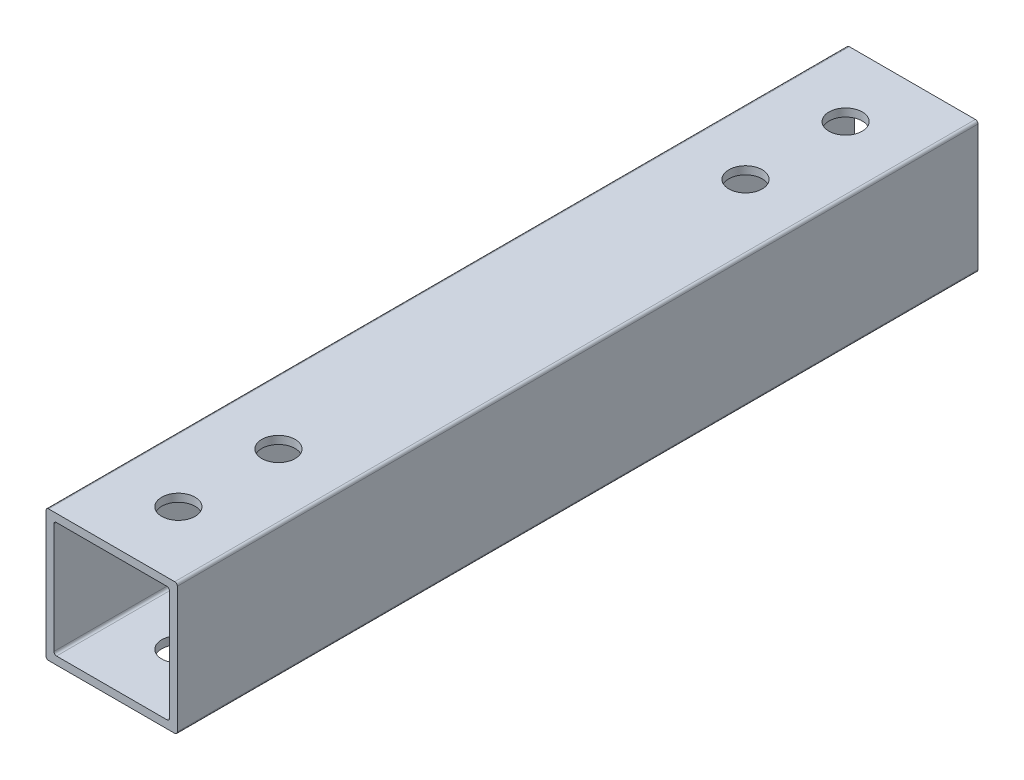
ISO-10303-21;
HEADER;
FILE_DESCRIPTION(('STEP AP214'),'2;1');
FILE_NAME('part.step','',(''),(''),'','','');
FILE_SCHEMA(('AUTOMOTIVE_DESIGN { 1 0 10303 214 1 1 1 1 }'));
ENDSEC;
DATA;
#1=APPLICATION_CONTEXT('core data for automotive mechanical design processes');
#2=APPLICATION_PROTOCOL_DEFINITION('international standard','automotive_design',2000,#1);
#3=PRODUCT_CONTEXT('',#1,'mechanical');
#4=PRODUCT('Part','Part','',(#3));
#5=PRODUCT_RELATED_PRODUCT_CATEGORY('part','',(#4));
#6=PRODUCT_DEFINITION_FORMATION('','',#4);
#7=PRODUCT_DEFINITION_CONTEXT('part definition',#1,'design');
#8=PRODUCT_DEFINITION('design','',#6,#7);
#9=PRODUCT_DEFINITION_SHAPE('','',#8);
#10=(LENGTH_UNIT() NAMED_UNIT(*) SI_UNIT(.MILLI.,.METRE.));
#11=(NAMED_UNIT(*) PLANE_ANGLE_UNIT() SI_UNIT($,.RADIAN.));
#12=(NAMED_UNIT(*) SI_UNIT($,.STERADIAN.) SOLID_ANGLE_UNIT());
#13=UNCERTAINTY_MEASURE_WITH_UNIT(LENGTH_MEASURE(1.E-05),#10,'distance_accuracy_value','');
#14=(GEOMETRIC_REPRESENTATION_CONTEXT(3) GLOBAL_UNCERTAINTY_ASSIGNED_CONTEXT((#13)) GLOBAL_UNIT_ASSIGNED_CONTEXT((#10,
#11,#12)) REPRESENTATION_CONTEXT('',''));
#15=CARTESIAN_POINT('',(0.,0.,0.));
#16=DIRECTION('',(0.,0.,1.));
#17=DIRECTION('',(1.,0.,0.));
#18=AXIS2_PLACEMENT_3D('',#15,#16,#17);
#19=CARTESIAN_POINT('',(-11.9999999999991,-11.9999999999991,-1847.6));
#20=DIRECTION('',(0.,0.,-1.));
#21=DIRECTION('',(-1.,0.,0.));
#22=AXIS2_PLACEMENT_3D('',#19,#20,#21);
#23=CYLINDRICAL_SURFACE('',#22,0.500000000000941);
#24=CARTESIAN_POINT('',(-11.9999999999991,-11.9999999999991,-2000.));
#25=DIRECTION('',(0.,0.,-1.));
#26=DIRECTION('',(-1.,0.,0.));
#27=AXIS2_PLACEMENT_3D('',#24,#25,#26);
#28=CIRCLE('',#27,0.500000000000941);
#29=CARTESIAN_POINT('',(-11.9999999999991,-12.5,-2000.));
#30=VERTEX_POINT('',#29);
#31=CARTESIAN_POINT('',(-12.5,-11.9999999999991,-2000.));
#32=VERTEX_POINT('',#31);
#33=EDGE_CURVE('E210',#30,#32,#28,.T.);
#34=ORIENTED_EDGE('',*,*,#33,.F.);
#35=DIRECTION('',(0.,0.,-1.));
#36=VECTOR('',#35,1.);
#37=CARTESIAN_POINT('',(-11.9999999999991,-12.5,-1847.6));
#38=LINE('',#37,#36);
#39=CARTESIAN_POINT('',(-11.9999999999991,-12.5,-1847.6));
#40=VERTEX_POINT('',#39);
#41=EDGE_CURVE('E11',#40,#30,#38,.T.);
#42=ORIENTED_EDGE('',*,*,#41,.F.);
#43=CARTESIAN_POINT('',(-11.9999999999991,-11.9999999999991,-1847.6));
#44=DIRECTION('',(0.,0.,-1.));
#45=DIRECTION('',(-1.,0.,0.));
#46=AXIS2_PLACEMENT_3D('',#43,#44,#45);
#47=CIRCLE('',#46,0.500000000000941);
#48=CARTESIAN_POINT('',(-12.5,-11.9999999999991,-1847.6));
#49=VERTEX_POINT('',#48);
#50=EDGE_CURVE('E222',#40,#49,#47,.T.);
#51=ORIENTED_EDGE('',*,*,#50,.T.);
#52=DIRECTION('',(0.,0.,-1.));
#53=VECTOR('',#52,1.);
#54=CARTESIAN_POINT('',(-12.5,-11.9999999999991,-1847.6));
#55=LINE('',#54,#53);
#56=EDGE_CURVE('E247',#49,#32,#55,.T.);
#57=ORIENTED_EDGE('',*,*,#56,.T.);
#58=EDGE_LOOP('',(#34,#42,#51,#57));
#59=FACE_BOUND('',#58,.T.);
#60=ADVANCED_FACE('F37',(#59),#23,.T.);
#61=CARTESIAN_POINT('',(11.9999999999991,-12.5,-1847.6));
#62=DIRECTION('',(0.,-1.,0.));
#63=DIRECTION('',(1.,0.,0.));
#64=AXIS2_PLACEMENT_3D('',#61,#62,#63);
#65=PLANE('',#64);
#66=CARTESIAN_POINT('',(0.,-12.5,-1860.3));
#67=DIRECTION('',(0.,-1.,0.));
#68=DIRECTION('',(1.,0.,0.));
#69=AXIS2_PLACEMENT_3D('',#66,#67,#68);
#70=CIRCLE('',#69,3.17500000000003);
#71=CARTESIAN_POINT('',(3.17500000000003,-12.5,-1860.3));
#72=VERTEX_POINT('',#71);
#73=EDGE_CURVE('E286',#72,#72,#70,.F.);
#74=ORIENTED_EDGE('',*,*,#73,.T.);
#75=EDGE_LOOP('',(#74));
#76=FACE_BOUND('',#75,.T.);
#77=CARTESIAN_POINT('',(0.,-12.5,-1968.25));
#78=DIRECTION('',(0.,-1.,0.));
#79=DIRECTION('',(1.,0.,0.));
#80=AXIS2_PLACEMENT_3D('',#77,#78,#79);
#81=CIRCLE('',#80,3.17500000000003);
#82=CARTESIAN_POINT('',(3.17500000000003,-12.5,-1968.25));
#83=VERTEX_POINT('',#82);
#84=EDGE_CURVE('E319',#83,#83,#81,.F.);
#85=ORIENTED_EDGE('',*,*,#84,.T.);
#86=EDGE_LOOP('',(#85));
#87=FACE_BOUND('',#86,.T.);
#88=CARTESIAN_POINT('',(0.,-12.5,-1987.3));
#89=DIRECTION('',(0.,-1.,0.));
#90=DIRECTION('',(1.,0.,0.));
#91=AXIS2_PLACEMENT_3D('',#88,#89,#90);
#92=CIRCLE('',#91,3.17500000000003);
#93=CARTESIAN_POINT('',(3.17500000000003,-12.5,-1987.3));
#94=VERTEX_POINT('',#93);
#95=EDGE_CURVE('E307',#94,#94,#92,.F.);
#96=ORIENTED_EDGE('',*,*,#95,.T.);
#97=EDGE_LOOP('',(#96));
#98=FACE_BOUND('',#97,.T.);
#99=CARTESIAN_POINT('',(0.,-12.5,-1879.35));
#100=DIRECTION('',(0.,-1.,0.));
#101=DIRECTION('',(1.,0.,0.));
#102=AXIS2_PLACEMENT_3D('',#99,#100,#101);
#103=CIRCLE('',#102,3.17500000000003);
#104=CARTESIAN_POINT('',(3.17500000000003,-12.5,-1879.35));
#105=VERTEX_POINT('',#104);
#106=EDGE_CURVE('E306',#105,#105,#103,.F.);
#107=ORIENTED_EDGE('',*,*,#106,.T.);
#108=EDGE_LOOP('',(#107));
#109=FACE_BOUND('',#108,.T.);
#110=DIRECTION('',(-1.,0.,0.));
#111=VECTOR('',#110,1.);
#112=CARTESIAN_POINT('',(11.9999999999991,-12.5,-2000.));
#113=LINE('',#112,#111);
#114=CARTESIAN_POINT('',(11.9999999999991,-12.5,-2000.));
#115=VERTEX_POINT('',#114);
#116=EDGE_CURVE('E226',#115,#30,#113,.T.);
#117=ORIENTED_EDGE('',*,*,#116,.F.);
#118=DIRECTION('',(0.,0.,-1.));
#119=VECTOR('',#118,1.);
#120=CARTESIAN_POINT('',(11.9999999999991,-12.5,-1847.6));
#121=LINE('',#120,#119);
#122=CARTESIAN_POINT('',(11.9999999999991,-12.5,-1847.6));
#123=VERTEX_POINT('',#122);
#124=EDGE_CURVE('E45',#123,#115,#121,.T.);
#125=ORIENTED_EDGE('',*,*,#124,.F.);
#126=DIRECTION('',(-1.,0.,0.));
#127=VECTOR('',#126,1.);
#128=CARTESIAN_POINT('',(11.9999999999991,-12.5,-1847.6));
#129=LINE('',#128,#127);
#130=EDGE_CURVE('E244',#123,#40,#129,.T.);
#131=ORIENTED_EDGE('',*,*,#130,.T.);
#132=ORIENTED_EDGE('',*,*,#41,.T.);
#133=EDGE_LOOP('',(#117,#125,#131,#132));
#134=FACE_BOUND('',#133,.T.);
#135=ADVANCED_FACE('F362',(#76,#87,#98,#109,#134),#65,.T.);
#136=CARTESIAN_POINT('',(11.9999999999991,-11.9999999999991,-1847.6));
#137=DIRECTION('',(0.,0.,-1.));
#138=DIRECTION('',(-1.,0.,0.));
#139=AXIS2_PLACEMENT_3D('',#136,#137,#138);
#140=CYLINDRICAL_SURFACE('',#139,0.500000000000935);
#141=CARTESIAN_POINT('',(11.9999999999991,-11.9999999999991,-2000.));
#142=DIRECTION('',(0.,0.,-1.));
#143=DIRECTION('',(-1.,0.,0.));
#144=AXIS2_PLACEMENT_3D('',#141,#142,#143);
#145=CIRCLE('',#144,0.500000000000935);
#146=CARTESIAN_POINT('',(12.5,-11.9999999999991,-2000.));
#147=VERTEX_POINT('',#146);
#148=EDGE_CURVE('E265',#147,#115,#145,.T.);
#149=ORIENTED_EDGE('',*,*,#148,.F.);
#150=DIRECTION('',(0.,0.,-1.));
#151=VECTOR('',#150,1.);
#152=CARTESIAN_POINT('',(12.5,-11.9999999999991,-1847.6));
#153=LINE('',#152,#151);
#154=CARTESIAN_POINT('',(12.5,-11.9999999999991,-1847.6));
#155=VERTEX_POINT('',#154);
#156=EDGE_CURVE('E271',#155,#147,#153,.T.);
#157=ORIENTED_EDGE('',*,*,#156,.F.);
#158=CARTESIAN_POINT('',(11.9999999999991,-11.9999999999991,-1847.6));
#159=DIRECTION('',(0.,0.,-1.));
#160=DIRECTION('',(-1.,0.,0.));
#161=AXIS2_PLACEMENT_3D('',#158,#159,#160);
#162=CIRCLE('',#161,0.500000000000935);
#163=EDGE_CURVE('E241',#155,#123,#162,.T.);
#164=ORIENTED_EDGE('',*,*,#163,.T.);
#165=ORIENTED_EDGE('',*,*,#124,.T.);
#166=EDGE_LOOP('',(#149,#157,#164,#165));
#167=FACE_BOUND('',#166,.T.);
#168=ADVANCED_FACE('F365',(#167),#140,.T.);
#169=CARTESIAN_POINT('',(12.5,11.9999999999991,-1847.6));
#170=DIRECTION('',(1.,0.,0.));
#171=DIRECTION('',(0.,1.,0.));
#172=AXIS2_PLACEMENT_3D('',#169,#170,#171);
#173=PLANE('',#172);
#174=DIRECTION('',(0.,-1.,0.));
#175=VECTOR('',#174,1.);
#176=CARTESIAN_POINT('',(12.5,11.9999999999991,-2000.));
#177=LINE('',#176,#175);
#178=CARTESIAN_POINT('',(12.5,11.9999999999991,-2000.));
#179=VERTEX_POINT('',#178);
#180=EDGE_CURVE('E262',#179,#147,#177,.T.);
#181=ORIENTED_EDGE('',*,*,#180,.F.);
#182=DIRECTION('',(0.,0.,-1.));
#183=VECTOR('',#182,1.);
#184=CARTESIAN_POINT('',(12.5,11.9999999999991,-1847.6));
#185=LINE('',#184,#183);
#186=CARTESIAN_POINT('',(12.5,11.9999999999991,-1847.6));
#187=VERTEX_POINT('',#186);
#188=EDGE_CURVE('E273',#187,#179,#185,.T.);
#189=ORIENTED_EDGE('',*,*,#188,.F.);
#190=DIRECTION('',(0.,-1.,0.));
#191=VECTOR('',#190,1.);
#192=CARTESIAN_POINT('',(12.5,11.9999999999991,-1847.6));
#193=LINE('',#192,#191);
#194=EDGE_CURVE('E238',#187,#155,#193,.T.);
#195=ORIENTED_EDGE('',*,*,#194,.T.);
#196=ORIENTED_EDGE('',*,*,#156,.T.);
#197=EDGE_LOOP('',(#181,#189,#195,#196));
#198=FACE_BOUND('',#197,.T.);
#199=ADVANCED_FACE('F369',(#198),#173,.T.);
#200=CARTESIAN_POINT('',(11.9999999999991,11.9999999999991,-1847.6));
#201=DIRECTION('',(0.,0.,-1.));
#202=DIRECTION('',(-1.,0.,0.));
#203=AXIS2_PLACEMENT_3D('',#200,#201,#202);
#204=CYLINDRICAL_SURFACE('',#203,0.500000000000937);
#205=CARTESIAN_POINT('',(11.9999999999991,11.9999999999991,-2000.));
#206=DIRECTION('',(0.,0.,-1.));
#207=DIRECTION('',(-1.,0.,0.));
#208=AXIS2_PLACEMENT_3D('',#205,#206,#207);
#209=CIRCLE('',#208,0.500000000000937);
#210=CARTESIAN_POINT('',(11.9999999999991,12.5,-2000.));
#211=VERTEX_POINT('',#210);
#212=EDGE_CURVE('E259',#211,#179,#209,.T.);
#213=ORIENTED_EDGE('',*,*,#212,.F.);
#214=DIRECTION('',(0.,0.,-1.));
#215=VECTOR('',#214,1.);
#216=CARTESIAN_POINT('',(11.9999999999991,12.5,-1847.6));
#217=LINE('',#216,#215);
#218=CARTESIAN_POINT('',(11.9999999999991,12.5,-1847.6));
#219=VERTEX_POINT('',#218);
#220=EDGE_CURVE('E275',#219,#211,#217,.T.);
#221=ORIENTED_EDGE('',*,*,#220,.F.);
#222=CARTESIAN_POINT('',(11.9999999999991,11.9999999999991,-1847.6));
#223=DIRECTION('',(0.,0.,-1.));
#224=DIRECTION('',(-1.,0.,0.));
#225=AXIS2_PLACEMENT_3D('',#222,#223,#224);
#226=CIRCLE('',#225,0.500000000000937);
#227=EDGE_CURVE('E235',#219,#187,#226,.T.);
#228=ORIENTED_EDGE('',*,*,#227,.T.);
#229=ORIENTED_EDGE('',*,*,#188,.T.);
#230=EDGE_LOOP('',(#213,#221,#228,#229));
#231=FACE_BOUND('',#230,.T.);
#232=ADVANCED_FACE('F334',(#231),#204,.T.);
#233=CARTESIAN_POINT('',(-11.9999999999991,12.5,-1847.6));
#234=DIRECTION('',(0.,1.,0.));
#235=DIRECTION('',(-1.,0.,0.));
#236=AXIS2_PLACEMENT_3D('',#233,#234,#235);
#237=PLANE('',#236);
#238=CARTESIAN_POINT('',(0.,12.5,-1860.3));
#239=DIRECTION('',(0.,1.,0.));
#240=DIRECTION('',(-1.,0.,0.));
#241=AXIS2_PLACEMENT_3D('',#238,#239,#240);
#242=CIRCLE('',#241,3.17500000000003);
#243=CARTESIAN_POINT('',(-3.17500000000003,12.5,-1860.3));
#244=VERTEX_POINT('',#243);
#245=EDGE_CURVE('E314',#244,#244,#242,.T.);
#246=ORIENTED_EDGE('',*,*,#245,.F.);
#247=EDGE_LOOP('',(#246));
#248=FACE_BOUND('',#247,.T.);
#249=CARTESIAN_POINT('',(0.,12.5,-1968.25));
#250=DIRECTION('',(0.,1.,0.));
#251=DIRECTION('',(1.,0.,0.));
#252=AXIS2_PLACEMENT_3D('',#249,#250,#251);
#253=CIRCLE('',#252,3.17500000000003);
#254=CARTESIAN_POINT('',(3.17500000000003,12.5,-1968.25));
#255=VERTEX_POINT('',#254);
#256=EDGE_CURVE('E310',#255,#255,#253,.T.);
#257=ORIENTED_EDGE('',*,*,#256,.F.);
#258=EDGE_LOOP('',(#257));
#259=FACE_BOUND('',#258,.T.);
#260=CARTESIAN_POINT('',(0.,12.5,-1987.3));
#261=DIRECTION('',(0.,1.,0.));
#262=DIRECTION('',(1.,0.,0.));
#263=AXIS2_PLACEMENT_3D('',#260,#261,#262);
#264=CIRCLE('',#263,3.17500000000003);
#265=CARTESIAN_POINT('',(3.17500000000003,12.5,-1987.3));
#266=VERTEX_POINT('',#265);
#267=EDGE_CURVE('E303',#266,#266,#264,.T.);
#268=ORIENTED_EDGE('',*,*,#267,.F.);
#269=EDGE_LOOP('',(#268));
#270=FACE_BOUND('',#269,.T.);
#271=CARTESIAN_POINT('',(0.,12.5,-1879.35));
#272=DIRECTION('',(0.,1.,0.));
#273=DIRECTION('',(-1.,0.,0.));
#274=AXIS2_PLACEMENT_3D('',#271,#272,#273);
#275=CIRCLE('',#274,3.17500000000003);
#276=CARTESIAN_POINT('',(-3.17500000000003,12.5,-1879.35));
#277=VERTEX_POINT('',#276);
#278=EDGE_CURVE('E311',#277,#277,#275,.T.);
#279=ORIENTED_EDGE('',*,*,#278,.F.);
#280=EDGE_LOOP('',(#279));
#281=FACE_BOUND('',#280,.T.);
#282=DIRECTION('',(1.,0.,0.));
#283=VECTOR('',#282,1.);
#284=CARTESIAN_POINT('',(-11.9999999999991,12.5,-2000.));
#285=LINE('',#284,#283);
#286=CARTESIAN_POINT('',(-11.9999999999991,12.5,-2000.));
#287=VERTEX_POINT('',#286);
#288=EDGE_CURVE('E256',#287,#211,#285,.T.);
#289=ORIENTED_EDGE('',*,*,#288,.F.);
#290=DIRECTION('',(0.,0.,-1.));
#291=VECTOR('',#290,1.);
#292=CARTESIAN_POINT('',(-11.9999999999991,12.5,-1847.6));
#293=LINE('',#292,#291);
#294=CARTESIAN_POINT('',(-11.9999999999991,12.5,-1847.6));
#295=VERTEX_POINT('',#294);
#296=EDGE_CURVE('E277',#295,#287,#293,.T.);
#297=ORIENTED_EDGE('',*,*,#296,.F.);
#298=DIRECTION('',(1.,0.,0.));
#299=VECTOR('',#298,1.);
#300=CARTESIAN_POINT('',(-11.9999999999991,12.5,-1847.6));
#301=LINE('',#300,#299);
#302=EDGE_CURVE('E232',#295,#219,#301,.T.);
#303=ORIENTED_EDGE('',*,*,#302,.T.);
#304=ORIENTED_EDGE('',*,*,#220,.T.);
#305=EDGE_LOOP('',(#289,#297,#303,#304));
#306=FACE_BOUND('',#305,.T.);
#307=ADVANCED_FACE('F330',(#248,#259,#270,#281,#306),#237,.T.);
#308=CARTESIAN_POINT('',(-11.9999999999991,11.9999999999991,-1847.6));
#309=DIRECTION('',(0.,0.,-1.));
#310=DIRECTION('',(-1.,0.,0.));
#311=AXIS2_PLACEMENT_3D('',#308,#309,#310);
#312=CYLINDRICAL_SURFACE('',#311,0.500000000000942);
#313=CARTESIAN_POINT('',(-11.9999999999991,11.9999999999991,-2000.));
#314=DIRECTION('',(0.,0.,-1.));
#315=DIRECTION('',(-1.,0.,0.));
#316=AXIS2_PLACEMENT_3D('',#313,#314,#315);
#317=CIRCLE('',#316,0.500000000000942);
#318=CARTESIAN_POINT('',(-12.5,11.9999999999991,-2000.));
#319=VERTEX_POINT('',#318);
#320=EDGE_CURVE('E253',#319,#287,#317,.T.);
#321=ORIENTED_EDGE('',*,*,#320,.F.);
#322=DIRECTION('',(0.,0.,-1.));
#323=VECTOR('',#322,1.);
#324=CARTESIAN_POINT('',(-12.5,11.9999999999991,-1847.6));
#325=LINE('',#324,#323);
#326=CARTESIAN_POINT('',(-12.5,11.9999999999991,-1847.6));
#327=VERTEX_POINT('',#326);
#328=EDGE_CURVE('E279',#327,#319,#325,.T.);
#329=ORIENTED_EDGE('',*,*,#328,.F.);
#330=CARTESIAN_POINT('',(-11.9999999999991,11.9999999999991,-1847.6));
#331=DIRECTION('',(0.,0.,-1.));
#332=DIRECTION('',(-1.,0.,0.));
#333=AXIS2_PLACEMENT_3D('',#330,#331,#332);
#334=CIRCLE('',#333,0.500000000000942);
#335=EDGE_CURVE('E229',#327,#295,#334,.T.);
#336=ORIENTED_EDGE('',*,*,#335,.T.);
#337=ORIENTED_EDGE('',*,*,#296,.T.);
#338=EDGE_LOOP('',(#321,#329,#336,#337));
#339=FACE_BOUND('',#338,.T.);
#340=ADVANCED_FACE('F333',(#339),#312,.T.);
#341=CARTESIAN_POINT('',(-12.5,-11.9999999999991,-1847.6));
#342=DIRECTION('',(-1.,0.,0.));
#343=DIRECTION('',(0.,0.,1.));
#344=AXIS2_PLACEMENT_3D('',#341,#342,#343);
#345=PLANE('',#344);
#346=DIRECTION('',(0.,1.,0.));
#347=VECTOR('',#346,1.);
#348=CARTESIAN_POINT('',(-12.5,-11.9999999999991,-2000.));
#349=LINE('',#348,#347);
#350=EDGE_CURVE('E250',#32,#319,#349,.T.);
#351=ORIENTED_EDGE('',*,*,#350,.F.);
#352=ORIENTED_EDGE('',*,*,#56,.F.);
#353=DIRECTION('',(0.,1.,0.));
#354=VECTOR('',#353,1.);
#355=CARTESIAN_POINT('',(-12.5,-11.9999999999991,-1847.6));
#356=LINE('',#355,#354);
#357=EDGE_CURVE('E225',#49,#327,#356,.T.);
#358=ORIENTED_EDGE('',*,*,#357,.T.);
#359=ORIENTED_EDGE('',*,*,#328,.T.);
#360=EDGE_LOOP('',(#351,#352,#358,#359));
#361=FACE_BOUND('',#360,.T.);
#362=ADVANCED_FACE('F355',(#361),#345,.T.);
#363=CARTESIAN_POINT('',(-11.9999999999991,-11.9999999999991,-1847.6));
#364=DIRECTION('',(0.,0.,-1.));
#365=DIRECTION('',(-1.,0.,0.));
#366=AXIS2_PLACEMENT_3D('',#363,#364,#365);
#367=PLANE('',#366);
#368=DIRECTION('',(0.,1.,0.));
#369=VECTOR('',#368,1.);
#370=CARTESIAN_POINT('',(-11.,10.4999999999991,-1847.6));
#371=LINE('',#370,#369);
#372=CARTESIAN_POINT('',(-11.,-10.4999999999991,-1847.6));
#373=VERTEX_POINT('',#372);
#374=CARTESIAN_POINT('',(-11.,10.4999999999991,-1847.6));
#375=VERTEX_POINT('',#374);
#376=EDGE_CURVE('E158',#373,#375,#371,.T.);
#377=ORIENTED_EDGE('',*,*,#376,.T.);
#378=CARTESIAN_POINT('',(-10.4999999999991,10.4999999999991,-1847.6));
#379=DIRECTION('',(0.,0.,-1.));
#380=DIRECTION('',(1.,0.,0.));
#381=AXIS2_PLACEMENT_3D('',#378,#379,#380);
#382=CIRCLE('',#381,0.500000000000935);
#383=CARTESIAN_POINT('',(-10.4999999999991,11.,-1847.6));
#384=VERTEX_POINT('',#383);
#385=EDGE_CURVE('E152',#375,#384,#382,.T.);
#386=ORIENTED_EDGE('',*,*,#385,.T.);
#387=DIRECTION('',(1.,0.,0.));
#388=VECTOR('',#387,1.);
#389=CARTESIAN_POINT('',(10.4999999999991,11.,-1847.6));
#390=LINE('',#389,#388);
#391=CARTESIAN_POINT('',(10.4999999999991,11.,-1847.6));
#392=VERTEX_POINT('',#391);
#393=EDGE_CURVE('E161',#384,#392,#390,.T.);
#394=ORIENTED_EDGE('',*,*,#393,.T.);
#395=CARTESIAN_POINT('',(10.4999999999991,10.4999999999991,-1847.6));
#396=DIRECTION('',(0.,0.,-1.));
#397=DIRECTION('',(1.,0.,0.));
#398=AXIS2_PLACEMENT_3D('',#395,#396,#397);
#399=CIRCLE('',#398,0.500000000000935);
#400=CARTESIAN_POINT('',(11.,10.4999999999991,-1847.6));
#401=VERTEX_POINT('',#400);
#402=EDGE_CURVE('E53',#392,#401,#399,.T.);
#403=ORIENTED_EDGE('',*,*,#402,.T.);
#404=DIRECTION('',(0.,-1.,0.));
#405=VECTOR('',#404,1.);
#406=CARTESIAN_POINT('',(11.,-10.4999999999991,-1847.6));
#407=LINE('',#406,#405);
#408=CARTESIAN_POINT('',(11.,-10.4999999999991,-1847.6));
#409=VERTEX_POINT('',#408);
#410=EDGE_CURVE('E179',#401,#409,#407,.T.);
#411=ORIENTED_EDGE('',*,*,#410,.T.);
#412=CARTESIAN_POINT('',(10.4999999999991,-10.4999999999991,-1847.6));
#413=DIRECTION('',(0.,0.,-1.));
#414=DIRECTION('',(1.,0.,0.));
#415=AXIS2_PLACEMENT_3D('',#412,#413,#414);
#416=CIRCLE('',#415,0.500000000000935);
#417=CARTESIAN_POINT('',(10.4999999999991,-11.,-1847.6));
#418=VERTEX_POINT('',#417);
#419=EDGE_CURVE('E182',#409,#418,#416,.T.);
#420=ORIENTED_EDGE('',*,*,#419,.T.);
#421=DIRECTION('',(-1.,0.,0.));
#422=VECTOR('',#421,1.);
#423=CARTESIAN_POINT('',(-10.4999999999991,-11.,-1847.6));
#424=LINE('',#423,#422);
#425=CARTESIAN_POINT('',(-10.4999999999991,-11.,-1847.6));
#426=VERTEX_POINT('',#425);
#427=EDGE_CURVE('E185',#418,#426,#424,.T.);
#428=ORIENTED_EDGE('',*,*,#427,.T.);
#429=CARTESIAN_POINT('',(-10.4999999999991,-10.4999999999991,-1847.6));
#430=DIRECTION('',(0.,0.,-1.));
#431=DIRECTION('',(1.,0.,0.));
#432=AXIS2_PLACEMENT_3D('',#429,#430,#431);
#433=CIRCLE('',#432,0.500000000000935);
#434=EDGE_CURVE('E188',#426,#373,#433,.T.);
#435=ORIENTED_EDGE('',*,*,#434,.T.);
#436=EDGE_LOOP('',(#377,#386,#394,#403,#411,#420,#428,#435));
#437=FACE_BOUND('',#436,.T.);
#438=ORIENTED_EDGE('',*,*,#50,.F.);
#439=ORIENTED_EDGE('',*,*,#130,.F.);
#440=ORIENTED_EDGE('',*,*,#163,.F.);
#441=ORIENTED_EDGE('',*,*,#194,.F.);
#442=ORIENTED_EDGE('',*,*,#227,.F.);
#443=ORIENTED_EDGE('',*,*,#302,.F.);
#444=ORIENTED_EDGE('',*,*,#335,.F.);
#445=ORIENTED_EDGE('',*,*,#357,.F.);
#446=EDGE_LOOP('',(#438,#439,#440,#441,#442,#443,#444,#445));
#447=FACE_BOUND('',#446,.T.);
#448=ADVANCED_FACE('F165',(#437,#447),#367,.F.);
#449=CARTESIAN_POINT('',(-11.9999999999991,-11.9999999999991,-2000.));
#450=DIRECTION('',(0.,0.,-1.));
#451=DIRECTION('',(-1.,0.,0.));
#452=AXIS2_PLACEMENT_3D('',#449,#450,#451);
#453=PLANE('',#452);
#454=CARTESIAN_POINT('',(-10.4999999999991,10.4999999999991,-2000.));
#455=DIRECTION('',(0.,0.,-1.));
#456=DIRECTION('',(1.,0.,0.));
#457=AXIS2_PLACEMENT_3D('',#454,#455,#456);
#458=CIRCLE('',#457,0.500000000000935);
#459=CARTESIAN_POINT('',(-11.,10.4999999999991,-2000.));
#460=VERTEX_POINT('',#459);
#461=CARTESIAN_POINT('',(-10.4999999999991,11.,-2000.));
#462=VERTEX_POINT('',#461);
#463=EDGE_CURVE('E61',#460,#462,#458,.T.);
#464=ORIENTED_EDGE('',*,*,#463,.F.);
#465=DIRECTION('',(0.,1.,0.));
#466=VECTOR('',#465,1.);
#467=CARTESIAN_POINT('',(-11.,10.4999999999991,-2000.));
#468=LINE('',#467,#466);
#469=CARTESIAN_POINT('',(-11.,-10.4999999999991,-2000.));
#470=VERTEX_POINT('',#469);
#471=EDGE_CURVE('E169',#470,#460,#468,.T.);
#472=ORIENTED_EDGE('',*,*,#471,.F.);
#473=CARTESIAN_POINT('',(-10.4999999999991,-10.4999999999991,-2000.));
#474=DIRECTION('',(0.,0.,-1.));
#475=DIRECTION('',(1.,0.,0.));
#476=AXIS2_PLACEMENT_3D('',#473,#474,#475);
#477=CIRCLE('',#476,0.500000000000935);
#478=CARTESIAN_POINT('',(-10.4999999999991,-11.,-2000.));
#479=VERTEX_POINT('',#478);
#480=EDGE_CURVE('E172',#479,#470,#477,.T.);
#481=ORIENTED_EDGE('',*,*,#480,.F.);
#482=DIRECTION('',(-1.,0.,0.));
#483=VECTOR('',#482,1.);
#484=CARTESIAN_POINT('',(-10.4999999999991,-11.,-2000.));
#485=LINE('',#484,#483);
#486=CARTESIAN_POINT('',(10.4999999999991,-11.,-2000.));
#487=VERTEX_POINT('',#486);
#488=EDGE_CURVE('E203',#487,#479,#485,.T.);
#489=ORIENTED_EDGE('',*,*,#488,.F.);
#490=CARTESIAN_POINT('',(10.4999999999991,-10.4999999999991,-2000.));
#491=DIRECTION('',(0.,0.,-1.));
#492=DIRECTION('',(1.,0.,0.));
#493=AXIS2_PLACEMENT_3D('',#490,#491,#492);
#494=CIRCLE('',#493,0.500000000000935);
#495=CARTESIAN_POINT('',(11.,-10.4999999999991,-2000.));
#496=VERTEX_POINT('',#495);
#497=EDGE_CURVE('E200',#496,#487,#494,.T.);
#498=ORIENTED_EDGE('',*,*,#497,.F.);
#499=DIRECTION('',(0.,-1.,0.));
#500=VECTOR('',#499,1.);
#501=CARTESIAN_POINT('',(11.,-10.4999999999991,-2000.));
#502=LINE('',#501,#500);
#503=CARTESIAN_POINT('',(11.,10.4999999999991,-2000.));
#504=VERTEX_POINT('',#503);
#505=EDGE_CURVE('E197',#504,#496,#502,.T.);
#506=ORIENTED_EDGE('',*,*,#505,.F.);
#507=CARTESIAN_POINT('',(10.4999999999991,10.4999999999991,-2000.));
#508=DIRECTION('',(0.,0.,-1.));
#509=DIRECTION('',(1.,0.,0.));
#510=AXIS2_PLACEMENT_3D('',#507,#508,#509);
#511=CIRCLE('',#510,0.500000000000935);
#512=CARTESIAN_POINT('',(10.4999999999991,11.,-2000.));
#513=VERTEX_POINT('',#512);
#514=EDGE_CURVE('E194',#513,#504,#511,.T.);
#515=ORIENTED_EDGE('',*,*,#514,.F.);
#516=DIRECTION('',(1.,0.,0.));
#517=VECTOR('',#516,1.);
#518=CARTESIAN_POINT('',(10.4999999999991,11.,-2000.));
#519=LINE('',#518,#517);
#520=EDGE_CURVE('E192',#462,#513,#519,.T.);
#521=ORIENTED_EDGE('',*,*,#520,.F.);
#522=EDGE_LOOP('',(#464,#472,#481,#489,#498,#506,#515,#521));
#523=FACE_BOUND('',#522,.T.);
#524=ORIENTED_EDGE('',*,*,#33,.T.);
#525=ORIENTED_EDGE('',*,*,#350,.T.);
#526=ORIENTED_EDGE('',*,*,#320,.T.);
#527=ORIENTED_EDGE('',*,*,#288,.T.);
#528=ORIENTED_EDGE('',*,*,#212,.T.);
#529=ORIENTED_EDGE('',*,*,#180,.T.);
#530=ORIENTED_EDGE('',*,*,#148,.T.);
#531=ORIENTED_EDGE('',*,*,#116,.T.);
#532=EDGE_LOOP('',(#524,#525,#526,#527,#528,#529,#530,#531));
#533=FACE_BOUND('',#532,.T.);
#534=ADVANCED_FACE('F347',(#523,#533),#453,.T.);
#535=CARTESIAN_POINT('',(-10.4999999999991,10.4999999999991,-1847.6));
#536=DIRECTION('',(0.,0.,-1.));
#537=DIRECTION('',(-1.,0.,0.));
#538=AXIS2_PLACEMENT_3D('',#535,#536,#537);
#539=CYLINDRICAL_SURFACE('',#538,0.500000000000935);
#540=ORIENTED_EDGE('',*,*,#463,.T.);
#541=DIRECTION('',(0.,0.,-1.));
#542=VECTOR('',#541,1.);
#543=CARTESIAN_POINT('',(-10.4999999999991,11.,-1847.6));
#544=LINE('',#543,#542);
#545=EDGE_CURVE('E148',#384,#462,#544,.T.);
#546=ORIENTED_EDGE('',*,*,#545,.F.);
#547=ORIENTED_EDGE('',*,*,#385,.F.);
#548=DIRECTION('',(0.,0.,-1.));
#549=VECTOR('',#548,1.);
#550=CARTESIAN_POINT('',(-11.,10.4999999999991,-1847.6));
#551=LINE('',#550,#549);
#552=EDGE_CURVE('E208',#375,#460,#551,.T.);
#553=ORIENTED_EDGE('',*,*,#552,.T.);
#554=EDGE_LOOP('',(#540,#546,#547,#553));
#555=FACE_BOUND('',#554,.T.);
#556=ADVANCED_FACE('F150',(#555),#539,.F.);
#557=CARTESIAN_POINT('',(-11.,10.4999999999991,-1847.6));
#558=DIRECTION('',(-1.,0.,0.));
#559=DIRECTION('',(0.,-1.,0.));
#560=AXIS2_PLACEMENT_3D('',#557,#558,#559);
#561=PLANE('',#560);
#562=ORIENTED_EDGE('',*,*,#471,.T.);
#563=ORIENTED_EDGE('',*,*,#552,.F.);
#564=ORIENTED_EDGE('',*,*,#376,.F.);
#565=DIRECTION('',(0.,0.,-1.));
#566=VECTOR('',#565,1.);
#567=CARTESIAN_POINT('',(-11.,-10.4999999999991,-1847.6));
#568=LINE('',#567,#566);
#569=EDGE_CURVE('E211',#373,#470,#568,.T.);
#570=ORIENTED_EDGE('',*,*,#569,.T.);
#571=EDGE_LOOP('',(#562,#563,#564,#570));
#572=FACE_BOUND('',#571,.T.);
#573=ADVANCED_FACE('F396',(#572),#561,.F.);
#574=CARTESIAN_POINT('',(-10.4999999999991,-10.4999999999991,-1847.6));
#575=DIRECTION('',(0.,0.,-1.));
#576=DIRECTION('',(-1.,0.,0.));
#577=AXIS2_PLACEMENT_3D('',#574,#575,#576);
#578=CYLINDRICAL_SURFACE('',#577,0.500000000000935);
#579=ORIENTED_EDGE('',*,*,#480,.T.);
#580=ORIENTED_EDGE('',*,*,#569,.F.);
#581=ORIENTED_EDGE('',*,*,#434,.F.);
#582=DIRECTION('',(0.,0.,-1.));
#583=VECTOR('',#582,1.);
#584=CARTESIAN_POINT('',(-10.4999999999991,-11.,-1847.6));
#585=LINE('',#584,#583);
#586=EDGE_CURVE('E213',#426,#479,#585,.T.);
#587=ORIENTED_EDGE('',*,*,#586,.T.);
#588=EDGE_LOOP('',(#579,#580,#581,#587));
#589=FACE_BOUND('',#588,.T.);
#590=ADVANCED_FACE('F415',(#589),#578,.F.);
#591=CARTESIAN_POINT('',(-10.4999999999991,-11.,-1847.6));
#592=DIRECTION('',(0.,-1.,0.));
#593=DIRECTION('',(0.,0.,-1.));
#594=AXIS2_PLACEMENT_3D('',#591,#592,#593);
#595=PLANE('',#594);
#596=CARTESIAN_POINT('',(0.,-11.,-1860.3));
#597=DIRECTION('',(0.,-1.,0.));
#598=DIRECTION('',(0.,0.,-1.));
#599=AXIS2_PLACEMENT_3D('',#596,#597,#598);
#600=CIRCLE('',#599,3.17500000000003);
#601=CARTESIAN_POINT('',(0.,-11.,-1863.475));
#602=VERTEX_POINT('',#601);
#603=EDGE_CURVE('E175',#602,#602,#600,.T.);
#604=ORIENTED_EDGE('',*,*,#603,.T.);
#605=EDGE_LOOP('',(#604));
#606=FACE_BOUND('',#605,.T.);
#607=CARTESIAN_POINT('',(0.,-11.,-1968.25));
#608=DIRECTION('',(0.,-1.,0.));
#609=DIRECTION('',(0.,0.,-1.));
#610=AXIS2_PLACEMENT_3D('',#607,#608,#609);
#611=CIRCLE('',#610,3.17500000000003);
#612=CARTESIAN_POINT('',(0.,-11.,-1971.425));
#613=VERTEX_POINT('',#612);
#614=EDGE_CURVE('E292',#613,#613,#611,.T.);
#615=ORIENTED_EDGE('',*,*,#614,.T.);
#616=EDGE_LOOP('',(#615));
#617=FACE_BOUND('',#616,.T.);
#618=CARTESIAN_POINT('',(0.,-11.,-1987.3));
#619=DIRECTION('',(0.,-1.,0.));
#620=DIRECTION('',(0.,0.,-1.));
#621=AXIS2_PLACEMENT_3D('',#618,#619,#620);
#622=CIRCLE('',#621,3.17500000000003);
#623=CARTESIAN_POINT('',(0.,-11.,-1990.475));
#624=VERTEX_POINT('',#623);
#625=EDGE_CURVE('E289',#624,#624,#622,.T.);
#626=ORIENTED_EDGE('',*,*,#625,.T.);
#627=EDGE_LOOP('',(#626));
#628=FACE_BOUND('',#627,.T.);
#629=CARTESIAN_POINT('',(0.,-11.,-1879.35));
#630=DIRECTION('',(0.,-1.,0.));
#631=DIRECTION('',(0.,0.,-1.));
#632=AXIS2_PLACEMENT_3D('',#629,#630,#631);
#633=CIRCLE('',#632,3.17500000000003);
#634=CARTESIAN_POINT('',(0.,-11.,-1882.525));
#635=VERTEX_POINT('',#634);
#636=EDGE_CURVE('E285',#635,#635,#633,.T.);
#637=ORIENTED_EDGE('',*,*,#636,.T.);
#638=EDGE_LOOP('',(#637));
#639=FACE_BOUND('',#638,.T.);
#640=ORIENTED_EDGE('',*,*,#488,.T.);
#641=ORIENTED_EDGE('',*,*,#586,.F.);
#642=ORIENTED_EDGE('',*,*,#427,.F.);
#643=DIRECTION('',(0.,0.,-1.));
#644=VECTOR('',#643,1.);
#645=CARTESIAN_POINT('',(10.4999999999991,-11.,-1847.6));
#646=LINE('',#645,#644);
#647=EDGE_CURVE('E215',#418,#487,#646,.T.);
#648=ORIENTED_EDGE('',*,*,#647,.T.);
#649=EDGE_LOOP('',(#640,#641,#642,#648));
#650=FACE_BOUND('',#649,.T.);
#651=ADVANCED_FACE('F411',(#606,#617,#628,#639,#650),#595,.F.);
#652=CARTESIAN_POINT('',(10.4999999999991,-10.4999999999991,-1847.6));
#653=DIRECTION('',(0.,0.,-1.));
#654=DIRECTION('',(-1.,0.,0.));
#655=AXIS2_PLACEMENT_3D('',#652,#653,#654);
#656=CYLINDRICAL_SURFACE('',#655,0.500000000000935);
#657=ORIENTED_EDGE('',*,*,#497,.T.);
#658=ORIENTED_EDGE('',*,*,#647,.F.);
#659=ORIENTED_EDGE('',*,*,#419,.F.);
#660=DIRECTION('',(0.,0.,-1.));
#661=VECTOR('',#660,1.);
#662=CARTESIAN_POINT('',(11.,-10.4999999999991,-1847.6));
#663=LINE('',#662,#661);
#664=EDGE_CURVE('E217',#409,#496,#663,.T.);
#665=ORIENTED_EDGE('',*,*,#664,.T.);
#666=EDGE_LOOP('',(#657,#658,#659,#665));
#667=FACE_BOUND('',#666,.T.);
#668=ADVANCED_FACE('F407',(#667),#656,.F.);
#669=CARTESIAN_POINT('',(11.,-10.4999999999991,-1847.6));
#670=DIRECTION('',(1.,0.,0.));
#671=DIRECTION('',(0.,0.,-1.));
#672=AXIS2_PLACEMENT_3D('',#669,#670,#671);
#673=PLANE('',#672);
#674=ORIENTED_EDGE('',*,*,#505,.T.);
#675=ORIENTED_EDGE('',*,*,#664,.F.);
#676=ORIENTED_EDGE('',*,*,#410,.F.);
#677=DIRECTION('',(0.,0.,-1.));
#678=VECTOR('',#677,1.);
#679=CARTESIAN_POINT('',(11.,10.4999999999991,-1847.6));
#680=LINE('',#679,#678);
#681=EDGE_CURVE('E219',#401,#504,#680,.T.);
#682=ORIENTED_EDGE('',*,*,#681,.T.);
#683=EDGE_LOOP('',(#674,#675,#676,#682));
#684=FACE_BOUND('',#683,.T.);
#685=ADVANCED_FACE('F404',(#684),#673,.F.);
#686=CARTESIAN_POINT('',(10.4999999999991,10.4999999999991,-1847.6));
#687=DIRECTION('',(0.,0.,-1.));
#688=DIRECTION('',(-1.,0.,0.));
#689=AXIS2_PLACEMENT_3D('',#686,#687,#688);
#690=CYLINDRICAL_SURFACE('',#689,0.500000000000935);
#691=ORIENTED_EDGE('',*,*,#514,.T.);
#692=ORIENTED_EDGE('',*,*,#681,.F.);
#693=ORIENTED_EDGE('',*,*,#402,.F.);
#694=DIRECTION('',(0.,0.,-1.));
#695=VECTOR('',#694,1.);
#696=CARTESIAN_POINT('',(10.4999999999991,11.,-1847.6));
#697=LINE('',#696,#695);
#698=EDGE_CURVE('E157',#392,#513,#697,.T.);
#699=ORIENTED_EDGE('',*,*,#698,.T.);
#700=EDGE_LOOP('',(#691,#692,#693,#699));
#701=FACE_BOUND('',#700,.T.);
#702=ADVANCED_FACE('F400',(#701),#690,.F.);
#703=CARTESIAN_POINT('',(10.4999999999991,11.,-1847.6));
#704=DIRECTION('',(0.,1.,0.));
#705=DIRECTION('',(-1.,0.,0.));
#706=AXIS2_PLACEMENT_3D('',#703,#704,#705);
#707=PLANE('',#706);
#708=CARTESIAN_POINT('',(0.,11.,-1860.3));
#709=DIRECTION('',(0.,1.,0.));
#710=DIRECTION('',(-1.,0.,0.));
#711=AXIS2_PLACEMENT_3D('',#708,#709,#710);
#712=CIRCLE('',#711,3.17500000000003);
#713=CARTESIAN_POINT('',(-3.17500000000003,11.,-1860.3));
#714=VERTEX_POINT('',#713);
#715=EDGE_CURVE('E40',#714,#714,#712,.T.);
#716=ORIENTED_EDGE('',*,*,#715,.T.);
#717=EDGE_LOOP('',(#716));
#718=FACE_BOUND('',#717,.T.);
#719=CARTESIAN_POINT('',(0.,11.,-1968.25));
#720=DIRECTION('',(0.,1.,0.));
#721=DIRECTION('',(-1.,0.,0.));
#722=AXIS2_PLACEMENT_3D('',#719,#720,#721);
#723=CIRCLE('',#722,3.17500000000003);
#724=CARTESIAN_POINT('',(-3.17500000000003,11.,-1968.25));
#725=VERTEX_POINT('',#724);
#726=EDGE_CURVE('E290',#725,#725,#723,.T.);
#727=ORIENTED_EDGE('',*,*,#726,.T.);
#728=EDGE_LOOP('',(#727));
#729=FACE_BOUND('',#728,.T.);
#730=CARTESIAN_POINT('',(0.,11.,-1987.3));
#731=DIRECTION('',(0.,1.,0.));
#732=DIRECTION('',(-1.,0.,0.));
#733=AXIS2_PLACEMENT_3D('',#730,#731,#732);
#734=CIRCLE('',#733,3.17500000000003);
#735=CARTESIAN_POINT('',(-3.17500000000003,11.,-1987.3));
#736=VERTEX_POINT('',#735);
#737=EDGE_CURVE('E287',#736,#736,#734,.T.);
#738=ORIENTED_EDGE('',*,*,#737,.T.);
#739=EDGE_LOOP('',(#738));
#740=FACE_BOUND('',#739,.T.);
#741=CARTESIAN_POINT('',(0.,11.,-1879.35));
#742=DIRECTION('',(0.,1.,0.));
#743=DIRECTION('',(-1.,0.,0.));
#744=AXIS2_PLACEMENT_3D('',#741,#742,#743);
#745=CIRCLE('',#744,3.17500000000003);
#746=CARTESIAN_POINT('',(-3.17500000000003,11.,-1879.35));
#747=VERTEX_POINT('',#746);
#748=EDGE_CURVE('E282',#747,#747,#745,.T.);
#749=ORIENTED_EDGE('',*,*,#748,.T.);
#750=EDGE_LOOP('',(#749));
#751=FACE_BOUND('',#750,.T.);
#752=ORIENTED_EDGE('',*,*,#520,.T.);
#753=ORIENTED_EDGE('',*,*,#698,.F.);
#754=ORIENTED_EDGE('',*,*,#393,.F.);
#755=ORIENTED_EDGE('',*,*,#545,.T.);
#756=EDGE_LOOP('',(#752,#753,#754,#755));
#757=FACE_BOUND('',#756,.T.);
#758=ADVANCED_FACE('F162',(#718,#729,#740,#751,#757),#707,.F.);
#759=CARTESIAN_POINT('',(0.,-21.4802561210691,-1879.35));
#760=DIRECTION('',(0.,1.,0.));
#761=DIRECTION('',(-1.,0.,0.));
#762=AXIS2_PLACEMENT_3D('',#759,#760,#761);
#763=CYLINDRICAL_SURFACE('',#762,3.17500000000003);
#764=ORIENTED_EDGE('',*,*,#278,.T.);
#765=EDGE_LOOP('',(#764));
#766=FACE_BOUND('',#765,.T.);
#767=ORIENTED_EDGE('',*,*,#748,.F.);
#768=EDGE_LOOP('',(#767));
#769=FACE_BOUND('',#768,.T.);
#770=ADVANCED_FACE('F399',(#766,#769),#763,.F.);
#771=CARTESIAN_POINT('',(0.,-21.4802561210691,-1987.3));
#772=DIRECTION('',(0.,1.,0.));
#773=DIRECTION('',(-1.,0.,0.));
#774=AXIS2_PLACEMENT_3D('',#771,#772,#773);
#775=CYLINDRICAL_SURFACE('',#774,3.17500000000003);
#776=ORIENTED_EDGE('',*,*,#267,.T.);
#777=EDGE_LOOP('',(#776));
#778=FACE_BOUND('',#777,.T.);
#779=ORIENTED_EDGE('',*,*,#737,.F.);
#780=EDGE_LOOP('',(#779));
#781=FACE_BOUND('',#780,.T.);
#782=ADVANCED_FACE('F429',(#778,#781),#775,.F.);
#783=CARTESIAN_POINT('',(0.,-21.4802561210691,-1968.25));
#784=DIRECTION('',(0.,1.,0.));
#785=DIRECTION('',(-1.,0.,0.));
#786=AXIS2_PLACEMENT_3D('',#783,#784,#785);
#787=CYLINDRICAL_SURFACE('',#786,3.17500000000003);
#788=ORIENTED_EDGE('',*,*,#256,.T.);
#789=EDGE_LOOP('',(#788));
#790=FACE_BOUND('',#789,.T.);
#791=ORIENTED_EDGE('',*,*,#726,.F.);
#792=EDGE_LOOP('',(#791));
#793=FACE_BOUND('',#792,.T.);
#794=ADVANCED_FACE('F437',(#790,#793),#787,.F.);
#795=CARTESIAN_POINT('',(0.,-21.4802561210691,-1860.3));
#796=DIRECTION('',(0.,1.,0.));
#797=DIRECTION('',(-1.,0.,0.));
#798=AXIS2_PLACEMENT_3D('',#795,#796,#797);
#799=CYLINDRICAL_SURFACE('',#798,3.17500000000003);
#800=ORIENTED_EDGE('',*,*,#245,.T.);
#801=EDGE_LOOP('',(#800));
#802=FACE_BOUND('',#801,.T.);
#803=ORIENTED_EDGE('',*,*,#715,.F.);
#804=EDGE_LOOP('',(#803));
#805=FACE_BOUND('',#804,.T.);
#806=ADVANCED_FACE('F327',(#802,#805),#799,.F.);
#807=ORIENTED_EDGE('',*,*,#106,.F.);
#808=EDGE_LOOP('',(#807));
#809=FACE_BOUND('',#808,.T.);
#810=ORIENTED_EDGE('',*,*,#636,.F.);
#811=EDGE_LOOP('',(#810));
#812=FACE_BOUND('',#811,.T.);
#813=ADVANCED_FACE('F427',(#809,#812),#763,.F.);
#814=ORIENTED_EDGE('',*,*,#95,.F.);
#815=EDGE_LOOP('',(#814));
#816=FACE_BOUND('',#815,.T.);
#817=ORIENTED_EDGE('',*,*,#625,.F.);
#818=EDGE_LOOP('',(#817));
#819=FACE_BOUND('',#818,.T.);
#820=ADVANCED_FACE('F423',(#816,#819),#775,.F.);
#821=ORIENTED_EDGE('',*,*,#84,.F.);
#822=EDGE_LOOP('',(#821));
#823=FACE_BOUND('',#822,.T.);
#824=ORIENTED_EDGE('',*,*,#614,.F.);
#825=EDGE_LOOP('',(#824));
#826=FACE_BOUND('',#825,.T.);
#827=ADVANCED_FACE('F426',(#823,#826),#787,.F.);
#828=ORIENTED_EDGE('',*,*,#73,.F.);
#829=EDGE_LOOP('',(#828));
#830=FACE_BOUND('',#829,.T.);
#831=ORIENTED_EDGE('',*,*,#603,.F.);
#832=EDGE_LOOP('',(#831));
#833=FACE_BOUND('',#832,.T.);
#834=ADVANCED_FACE('F435',(#830,#833),#799,.F.);
#835=CLOSED_SHELL('',(#60,#135,#168,#199,#232,#307,#340,#362,#448,#534,#556,#573,#590,#651,#668,
#685,#702,#758,#770,#782,#794,#806,#813,#820,#827,#834));
#836=MANIFOLD_SOLID_BREP('B2',#835);
#837=ADVANCED_BREP_SHAPE_REPRESENTATION('',(#18,#836),#14);
#838=SHAPE_DEFINITION_REPRESENTATION(#9,#837);
ENDSEC;
END-ISO-10303-21;
